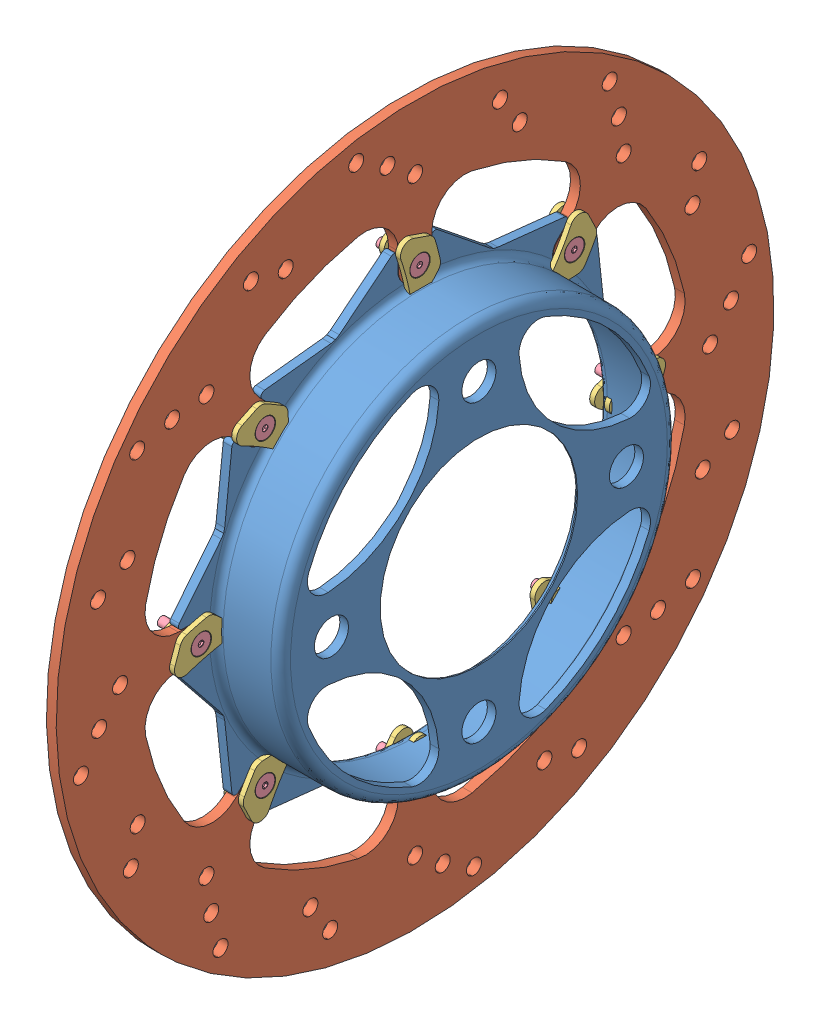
SolidWorks assembly Brake Rotor Assembly.SLDASM, configuration Default (file format 4400). Lengths in mm.
Overall size (31.81 327.78 327.78).
26 component instances, 4 part files, 10 mates.
Components (placement in the parent):
- Rotor Hat-1: Rotor Hat.SLDPRT [Default] at (-34.2242 30.4071 -2.5985) size (23.6 152.4 152.4)
- Rotor - Cast Iron-1: Rotor - Cast Iron.SLDPRT [Default] at (-34.4147 30.4071 -2.5985) x (0 -0.707107 0.707107) z (1 0 0) size (231.78 231.78 3.17)
- Rotor Washer-1: Rotor Washer.SLDPRT [Default] at (-34.4147 -45.1409 39.6169) x (0 -0.351842 0.936059) z (-1 0 0) size (18.57 10.78 1.59)
- Rotor Washer-27: Rotor Washer.SLDPRT [Chamfer] at (-31.2397 -47.6779 47.6027) x (0 0.252895 -0.967494) z (1 0 0) size (18.57 10.78 1.59)
- Rotor Pin-6: Rotor Pin.SLDPRT [.5] at (-31.201 30.4071 68.0135) x (0 -0.458801 0.888539) z (1 0 0) size (6.36 6.36 12.79)
- Rotor Washer-13: Rotor Washer.SLDPRT [Default] at (-34.4147 6.8374 80.6728) x (0 0.413104 0.910684) z (-1 0 0) size (18.57 10.78 1.59)
- Rotor Washer-14: Rotor Washer.SLDPRT [Default] at (-34.4147 72.6224 72.9495) x (0 0.936059 0.351842) z (-1 0 0) size (18.57 10.78 1.59)
- Rotor Washer-15: Rotor Washer.SLDPRT [Default] at (-34.4147 113.6783 20.9712) x (0 0.910684 -0.413104) z (-1 0 0) size (18.57 10.78 1.59)
- Rotor Washer-16: Rotor Washer.SLDPRT [Default] at (-34.4147 105.955 -44.8139) x (0 0.351842 -0.936059) z (-1 0 0) size (18.57 10.78 1.59)
- Rotor Washer-17: Rotor Washer.SLDPRT [Default] at (-34.4147 53.9768 -85.8697) x (0 -0.413104 -0.910684) z (-1 0 0) size (18.57 10.78 1.59)
- Rotor Pin-7: Rotor Pin.SLDPRT [.5] at (-31.201 80.3373 47.3317) x (0 0.30387 0.952713) z (1 0 0) size (6.36 6.36 12.79)
- Rotor Pin-8: Rotor Pin.SLDPRT [.5] at (-31.201 101.0191 -2.5985) x (0 0.888539 0.458801) z (1 0 0) size (6.36 6.36 12.79)
- Rotor Pin-9: Rotor Pin.SLDPRT [.5] at (-31.201 80.3373 -52.5287) x (0 0.952713 -0.30387) z (1 0 0) size (6.36 6.36 12.79)
- Rotor Pin-10: Rotor Pin.SLDPRT [.5] at (-31.201 30.4071 -73.2105) x (0 0.458801 -0.888539) z (1 0 0) size (6.36 6.36 12.79)
- Rotor Pin-11: Rotor Pin.SLDPRT [.5] at (-31.201 -19.5231 -52.5287) x (0 -0.30387 -0.952713) z (1 0 0) size (6.36 6.36 12.79)
- Rotor Pin-12: Rotor Pin.SLDPRT [.5] at (-31.201 -40.2049 -2.5985) x (0 -0.888539 -0.458801) z (1 0 0) size (6.36 6.36 12.79)
- Rotor Pin-13: Rotor Pin.SLDPRT [.5] at (-31.201 -19.5231 47.3317) x (0 -0.952713 0.30387) z (1 0 0) size (6.36 6.36 12.79)
- Rotor Washer-25: Rotor Washer.SLDPRT [Default] at (-34.4147 -11.8083 -78.1464) x (0 -0.936059 -0.351842) z (-1 0 0) size (18.57 10.78 1.59)
- Rotor Washer-26: Rotor Washer.SLDPRT [Default] at (-34.4147 -52.8642 -26.1682) x (0 -0.910684 0.413104) z (-1 0 0) size (18.57 10.78 1.59)
- Rotor Washer-28: Rotor Washer.SLDPRT [Chamfer] at (-31.2397 10.6903 88.1135) x (0 -0.505298 -0.862945) z (1 0 0) size (18.57 10.78 1.59)
- Rotor Washer-29: Rotor Washer.SLDPRT [Chamfer] at (-31.2397 80.6083 75.4865) x (0 -0.967494 -0.252895) z (1 0 0) size (18.57 10.78 1.59)
- Rotor Washer-30: Rotor Washer.SLDPRT [Chamfer] at (-31.2397 121.1191 17.1183) x (0 -0.862945 0.505298) z (1 0 0) size (18.57 10.78 1.59)
- Rotor Washer-31: Rotor Washer.SLDPRT [Chamfer] at (-31.2397 108.492 -52.7997) x (0 -0.252895 0.967494) z (1 0 0) size (18.57 10.78 1.59)
- Rotor Washer-32: Rotor Washer.SLDPRT [Chamfer] at (-31.2397 50.1239 -93.3105) x (0 0.505298 0.862945) z (1 0 0) size (18.57 10.78 1.59)
- Rotor Washer-33: Rotor Washer.SLDPRT [Chamfer] at (-31.2397 -19.7942 -80.6835) x (0 0.967494 0.252895) z (1 0 0) size (18.57 10.78 1.59)
- Rotor Washer-34: Rotor Washer.SLDPRT [Chamfer] at (-31.2397 -60.305 -22.3153) x (0 0.862945 -0.505298) z (1 0 0) size (18.57 10.78 1.59)
Mates (geometry in assembly coordinates):
- Coincident1: coincident anti-aligned: plane of Rotor - Cast Iron-1 through (-34.4157 106.8152 2.799) normal (0 0 1); plane of Rotor Hat-1 through (-10.6199 -44.5229 2.799) normal (0 0 -1)
- Distance1: distance = 0.1905 mm aligned: plane of Rotor Hat-1 through (-34.2242 95.5581 -2.5985) normal (-1 0 0); plane of Rotor - Cast Iron-1 through (-34.4147 210.7857 177.7802) normal (-1 0 0)
- Distance2: distance = 0.1905 mm aligned: plane of Rotor Hat-1 through (-34.2242 95.5581 -2.5985) normal (-1 0 0); plane of Rotor - Cast Iron-1 through (-31.2397 210.7857 177.7802) normal (1 0 0)
- Coincident3: coincident anti-aligned: plane of Rotor - Cast Iron-1 through (-34.4147 210.7857 177.7802) normal (-1 0 0); plane of Rotor Washer-1 through (-34.4147 31.8488 71.9473) normal (1 0 0)
- Concentric4: concentric aligned: cylinder of Rotor Washer-1 through (-36.0022 30.4071 68.0135) axis (1 0 0) radius 1.5875; cylinder of Rotor - Cast Iron-1 through (-34.4157 30.4071 68.0135) axis (1 0 0) radius 1.5875
- Coincident5: coincident anti-aligned: plane of Rotor - Cast Iron-1 through (-31.2397 210.7857 177.7802) normal (1 0 0); plane of Rotor Washer-27 through (-31.2397 33.8548 65.633) normal (-1 0 0)
- Concentric9: concentric anti-aligned: cylinder of Rotor Pin-6 through (-31.201 30.4071 68.0135) axis (-1 0 0) radius 1.4224; cylinder of Rotor - Cast Iron-1 through (-34.4157 30.4071 68.0135) axis (1 0 0) radius 1.5875
- Coincident6: coincident aligned: cone of Rotor Washer-27 through (-31.6245 30.4071 68.0135) axis (-1 0 0); cone of Rotor Pin-6 through (-29.7252 30.4071 68.0135) axis (-1 0 0)
- Concentric12: concentric anti-aligned: cylinder of Rotor - Cast Iron-1 through (-31.2397 30.4071 -2.5985) axis (-1 0 0) radius 115.8875; circle of Rotor Hat-1
- Concentric13: concentric anti-aligned: cylinder of Rotor - Cast Iron-1 through (-31.2397 30.4071 -2.5985) axis (-1 0 0) radius 115.8875; cylinder of Rotor Hat-1 through (-8.3543 30.4071 -2.5985) axis (1 0 0) radius 64.008
